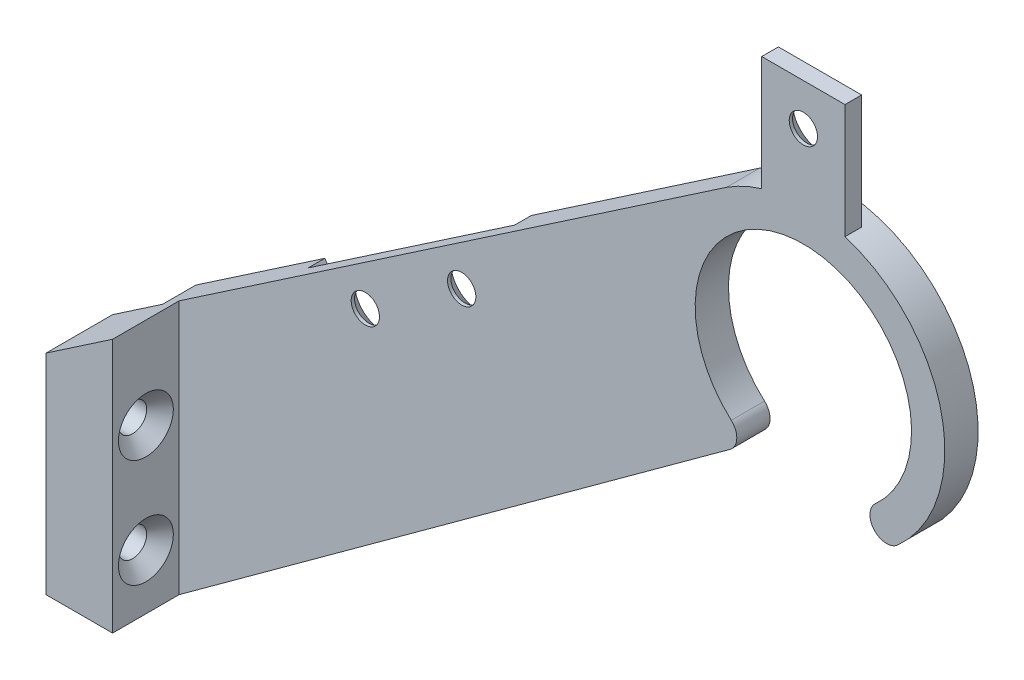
ISO-10303-21;
HEADER;
FILE_DESCRIPTION(('STEP AP214'),'2;1');
FILE_NAME('part.step','',(''),(''),'','','');
FILE_SCHEMA(('AUTOMOTIVE_DESIGN { 1 0 10303 214 1 1 1 1 }'));
ENDSEC;
DATA;
#1=APPLICATION_CONTEXT('core data for automotive mechanical design processes');
#2=APPLICATION_PROTOCOL_DEFINITION('international standard','automotive_design',2000,#1);
#3=PRODUCT_CONTEXT('',#1,'mechanical');
#4=PRODUCT('Part','Part','',(#3));
#5=PRODUCT_RELATED_PRODUCT_CATEGORY('part','',(#4));
#6=PRODUCT_DEFINITION_FORMATION('','',#4);
#7=PRODUCT_DEFINITION_CONTEXT('part definition',#1,'design');
#8=PRODUCT_DEFINITION('design','',#6,#7);
#9=PRODUCT_DEFINITION_SHAPE('','',#8);
#10=(LENGTH_UNIT() NAMED_UNIT(*) SI_UNIT(.MILLI.,.METRE.));
#11=(NAMED_UNIT(*) PLANE_ANGLE_UNIT() SI_UNIT($,.RADIAN.));
#12=(NAMED_UNIT(*) SI_UNIT($,.STERADIAN.) SOLID_ANGLE_UNIT());
#13=UNCERTAINTY_MEASURE_WITH_UNIT(LENGTH_MEASURE(1.E-05),#10,'distance_accuracy_value','');
#14=(GEOMETRIC_REPRESENTATION_CONTEXT(3) GLOBAL_UNCERTAINTY_ASSIGNED_CONTEXT((#13)) GLOBAL_UNIT_ASSIGNED_CONTEXT((#10,
#11,#12)) REPRESENTATION_CONTEXT('',''));
#15=CARTESIAN_POINT('',(0.,0.,0.));
#16=DIRECTION('',(0.,0.,1.));
#17=DIRECTION('',(1.,0.,0.));
#18=AXIS2_PLACEMENT_3D('',#15,#16,#17);
#19=CARTESIAN_POINT('',(-6.00000000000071,12.6393524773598,4.));
#20=DIRECTION('',(1.,0.,0.));
#21=DIRECTION('',(0.,1.,0.));
#22=AXIS2_PLACEMENT_3D('',#19,#20,#21);
#23=PLANE('',#22);
#24=CARTESIAN_POINT('',(-6.0000000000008,-5.86064752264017,8.));
#25=DIRECTION('',(1.,0.,0.));
#26=DIRECTION('',(0.,0.,-1.));
#27=AXIS2_PLACEMENT_3D('',#24,#25,#26);
#28=CIRCLE('',#27,1.7);
#29=CARTESIAN_POINT('',(-6.0000000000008,-5.86064752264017,6.3));
#30=VERTEX_POINT('',#29);
#31=EDGE_CURVE('E283',#30,#30,#28,.T.);
#32=ORIENTED_EDGE('',*,*,#31,.T.);
#33=EDGE_LOOP('',(#32));
#34=FACE_BOUND('',#33,.T.);
#35=CARTESIAN_POINT('',(-6.00000000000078,7.13935247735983,8.));
#36=DIRECTION('',(1.,0.,0.));
#37=DIRECTION('',(0.,0.,-1.));
#38=AXIS2_PLACEMENT_3D('',#35,#36,#37);
#39=CIRCLE('',#38,1.7);
#40=CARTESIAN_POINT('',(-6.00000000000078,7.13935247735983,6.3));
#41=VERTEX_POINT('',#40);
#42=EDGE_CURVE('E274',#41,#41,#39,.T.);
#43=ORIENTED_EDGE('',*,*,#42,.T.);
#44=EDGE_LOOP('',(#43));
#45=FACE_BOUND('',#44,.T.);
#46=DIRECTION('',(0.,1.,0.));
#47=VECTOR('',#46,1.);
#48=CARTESIAN_POINT('',(-6.00000000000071,12.6393524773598,4.));
#49=LINE('',#48,#47);
#50=CARTESIAN_POINT('',(-6.00000000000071,-12.5000000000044,4.));
#51=VERTEX_POINT('',#50);
#52=CARTESIAN_POINT('',(-6.00000000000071,12.6393524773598,4.));
#53=VERTEX_POINT('',#52);
#54=EDGE_CURVE('E178',#51,#53,#49,.T.);
#55=ORIENTED_EDGE('',*,*,#54,.F.);
#56=DIRECTION('',(0.,0.,-1.));
#57=VECTOR('',#56,1.);
#58=CARTESIAN_POINT('',(-6.00000000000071,-12.5000000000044,4.));
#59=LINE('',#58,#57);
#60=CARTESIAN_POINT('',(-6.00000000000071,-12.5000000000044,12.));
#61=VERTEX_POINT('',#60);
#62=EDGE_CURVE('E348',#61,#51,#59,.T.);
#63=ORIENTED_EDGE('',*,*,#62,.F.);
#64=DIRECTION('',(0.,-1.,0.));
#65=VECTOR('',#64,1.);
#66=CARTESIAN_POINT('',(-6.00000000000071,12.6393524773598,12.));
#67=LINE('',#66,#65);
#68=CARTESIAN_POINT('',(-6.00000000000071,12.6393524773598,12.));
#69=VERTEX_POINT('',#68);
#70=EDGE_CURVE('E290',#69,#61,#67,.T.);
#71=ORIENTED_EDGE('',*,*,#70,.F.);
#72=DIRECTION('',(0.,0.,-1.));
#73=VECTOR('',#72,1.);
#74=CARTESIAN_POINT('',(-6.00000000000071,12.6393524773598,4.));
#75=LINE('',#74,#73);
#76=EDGE_CURVE('E351',#69,#53,#75,.T.);
#77=ORIENTED_EDGE('',*,*,#76,.T.);
#78=EDGE_LOOP('',(#55,#63,#71,#77));
#79=FACE_BOUND('',#78,.T.);
#80=ADVANCED_FACE('F39',(#34,#45,#79),#23,.F.);
#81=CARTESIAN_POINT('',(76.9999999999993,48.4999999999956,4.));
#82=DIRECTION('',(0.,0.,-1.));
#83=DIRECTION('',(-1.,0.,0.));
#84=AXIS2_PLACEMENT_3D('',#81,#82,#83);
#85=CYLINDRICAL_SURFACE('',#84,17.);
#86=DIRECTION('',(0.,0.,-1.));
#87=VECTOR('',#86,1.);
#88=CARTESIAN_POINT('',(71.9999999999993,64.7480768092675,4.));
#89=LINE('',#88,#87);
#90=CARTESIAN_POINT('',(71.9999999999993,64.7480768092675,2.));
#91=VERTEX_POINT('',#90);
#92=CARTESIAN_POINT('',(71.9999999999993,64.7480768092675,4.));
#93=VERTEX_POINT('',#92);
#94=EDGE_CURVE('E224',#91,#93,#89,.F.);
#95=ORIENTED_EDGE('',*,*,#94,.F.);
#96=CARTESIAN_POINT('',(76.9999999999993,48.4999999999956,2.));
#97=DIRECTION('',(0.,0.,-1.));
#98=DIRECTION('',(-1.,0.,0.));
#99=AXIS2_PLACEMENT_3D('',#96,#97,#98);
#100=CIRCLE('',#99,17.);
#101=CARTESIAN_POINT('',(81.9999999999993,64.7480768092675,2.));
#102=VERTEX_POINT('',#101);
#103=EDGE_CURVE('E47',#91,#102,#100,.T.);
#104=ORIENTED_EDGE('',*,*,#103,.T.);
#105=DIRECTION('',(0.,0.,-1.));
#106=VECTOR('',#105,1.);
#107=CARTESIAN_POINT('',(81.9999999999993,64.7480768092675,4.));
#108=LINE('',#107,#106);
#109=CARTESIAN_POINT('',(81.9999999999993,64.7480768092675,4.));
#110=VERTEX_POINT('',#109);
#111=EDGE_CURVE('E222',#110,#102,#108,.T.);
#112=ORIENTED_EDGE('',*,*,#111,.F.);
#113=CARTESIAN_POINT('',(76.9999999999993,48.4999999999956,4.));
#114=DIRECTION('',(0.,0.,1.));
#115=DIRECTION('',(1.,0.,0.));
#116=AXIS2_PLACEMENT_3D('',#113,#114,#115);
#117=CIRCLE('',#116,17.);
#118=CARTESIAN_POINT('',(88.3333333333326,35.8289481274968,4.));
#119=VERTEX_POINT('',#118);
#120=EDGE_CURVE('E311',#119,#110,#117,.T.);
#121=ORIENTED_EDGE('',*,*,#120,.F.);
#122=DIRECTION('',(0.,0.,-1.));
#123=VECTOR('',#122,1.);
#124=CARTESIAN_POINT('',(88.3333333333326,35.8289481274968,4.));
#125=LINE('',#124,#123);
#126=CARTESIAN_POINT('',(88.3333333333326,35.8289481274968,0.));
#127=VERTEX_POINT('',#126);
#128=EDGE_CURVE('E356',#119,#127,#125,.T.);
#129=ORIENTED_EDGE('',*,*,#128,.T.);
#130=CARTESIAN_POINT('',(76.9999999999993,48.4999999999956,0.));
#131=DIRECTION('',(0.,0.,1.));
#132=DIRECTION('',(1.,0.,0.));
#133=AXIS2_PLACEMENT_3D('',#130,#131,#132);
#134=CIRCLE('',#133,17.);
#135=CARTESIAN_POINT('',(67.7706376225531,62.7765146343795,0.));
#136=VERTEX_POINT('',#135);
#137=EDGE_CURVE('E325',#127,#136,#134,.T.);
#138=ORIENTED_EDGE('',*,*,#137,.T.);
#139=DIRECTION('',(0.,0.,-1.));
#140=VECTOR('',#139,1.);
#141=CARTESIAN_POINT('',(67.7706376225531,62.7765146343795,4.));
#142=LINE('',#141,#140);
#143=CARTESIAN_POINT('',(67.7706376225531,62.7765146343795,4.));
#144=VERTEX_POINT('',#143);
#145=EDGE_CURVE('E353',#144,#136,#142,.T.);
#146=ORIENTED_EDGE('',*,*,#145,.F.);
#147=EDGE_CURVE('E309',#93,#144,#117,.T.);
#148=ORIENTED_EDGE('',*,*,#147,.F.);
#149=EDGE_LOOP('',(#95,#104,#112,#121,#129,#138,#146,#148));
#150=FACE_BOUND('',#149,.T.);
#151=ADVANCED_FACE('F452',(#150),#85,.T.);
#152=CARTESIAN_POINT('',(1.99999999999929,12.6393524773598,12.));
#153=DIRECTION('',(-1.,0.,0.));
#154=DIRECTION('',(0.,-1.,0.));
#155=AXIS2_PLACEMENT_3D('',#152,#153,#154);
#156=PLANE('',#155);
#157=CARTESIAN_POINT('',(1.99999999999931,7.13935247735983,8.));
#158=DIRECTION('',(1.,0.,0.));
#159=DIRECTION('',(0.,0.,-1.));
#160=AXIS2_PLACEMENT_3D('',#157,#158,#159);
#161=CIRCLE('',#160,3.3);
#162=CARTESIAN_POINT('',(1.99999999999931,7.13935247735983,4.7));
#163=VERTEX_POINT('',#162);
#164=EDGE_CURVE('E262',#163,#163,#161,.T.);
#165=ORIENTED_EDGE('',*,*,#164,.F.);
#166=EDGE_LOOP('',(#165));
#167=FACE_BOUND('',#166,.T.);
#168=DIRECTION('',(0.,1.,0.));
#169=VECTOR('',#168,1.);
#170=CARTESIAN_POINT('',(1.99999999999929,12.6393524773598,4.));
#171=LINE('',#170,#169);
#172=CARTESIAN_POINT('',(1.99999999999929,-12.5000000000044,4.));
#173=VERTEX_POINT('',#172);
#174=CARTESIAN_POINT('',(1.99999999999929,18.0764384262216,4.));
#175=VERTEX_POINT('',#174);
#176=EDGE_CURVE('E286',#173,#175,#171,.T.);
#177=ORIENTED_EDGE('',*,*,#176,.T.);
#178=DIRECTION('',(0.,0.,-1.));
#179=VECTOR('',#178,1.);
#180=CARTESIAN_POINT('',(1.99999999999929,18.0764384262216,12.));
#181=LINE('',#180,#179);
#182=CARTESIAN_POINT('',(1.99999999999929,18.0764384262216,12.));
#183=VERTEX_POINT('',#182);
#184=EDGE_CURVE('E297',#183,#175,#181,.T.);
#185=ORIENTED_EDGE('',*,*,#184,.F.);
#186=DIRECTION('',(0.,1.,0.));
#187=VECTOR('',#186,1.);
#188=CARTESIAN_POINT('',(1.99999999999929,12.6393524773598,12.));
#189=LINE('',#188,#187);
#190=CARTESIAN_POINT('',(1.99999999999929,-12.5000000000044,12.));
#191=VERTEX_POINT('',#190);
#192=EDGE_CURVE('E295',#191,#183,#189,.T.);
#193=ORIENTED_EDGE('',*,*,#192,.F.);
#194=DIRECTION('',(0.,0.,-1.));
#195=VECTOR('',#194,1.);
#196=CARTESIAN_POINT('',(1.99999999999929,-12.5000000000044,12.));
#197=LINE('',#196,#195);
#198=EDGE_CURVE('E302',#191,#173,#197,.T.);
#199=ORIENTED_EDGE('',*,*,#198,.T.);
#200=EDGE_LOOP('',(#177,#185,#193,#199));
#201=FACE_BOUND('',#200,.T.);
#202=CARTESIAN_POINT('',(1.99999999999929,-5.86064752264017,8.));
#203=DIRECTION('',(1.,0.,0.));
#204=DIRECTION('',(0.,0.,-1.));
#205=AXIS2_PLACEMENT_3D('',#202,#203,#204);
#206=CIRCLE('',#205,3.3);
#207=CARTESIAN_POINT('',(1.99999999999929,-5.86064752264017,4.7));
#208=VERTEX_POINT('',#207);
#209=EDGE_CURVE('E277',#208,#208,#206,.T.);
#210=ORIENTED_EDGE('',*,*,#209,.F.);
#211=EDGE_LOOP('',(#210));
#212=FACE_BOUND('',#211,.T.);
#213=ADVANCED_FACE('F432',(#167,#201,#212),#156,.F.);
#214=CARTESIAN_POINT('',(86.9999999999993,37.3196601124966,4.));
#215=DIRECTION('',(0.,0.,-1.));
#216=DIRECTION('',(-1.,0.,0.));
#217=AXIS2_PLACEMENT_3D('',#214,#215,#216);
#218=CYLINDRICAL_SURFACE('',#217,2.00000000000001);
#219=CARTESIAN_POINT('',(86.9999999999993,37.3196601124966,0.));
#220=DIRECTION('',(0.,0.,1.));
#221=DIRECTION('',(1.,0.,0.));
#222=AXIS2_PLACEMENT_3D('',#219,#220,#221);
#223=CIRCLE('',#222,2.00000000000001);
#224=CARTESIAN_POINT('',(85.666666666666,38.8103720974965,0.));
#225=VERTEX_POINT('',#224);
#226=EDGE_CURVE('E305',#225,#127,#223,.T.);
#227=ORIENTED_EDGE('',*,*,#226,.T.);
#228=ORIENTED_EDGE('',*,*,#128,.F.);
#229=CARTESIAN_POINT('',(86.9999999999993,37.3196601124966,4.));
#230=DIRECTION('',(0.,0.,1.));
#231=DIRECTION('',(1.,0.,0.));
#232=AXIS2_PLACEMENT_3D('',#229,#230,#231);
#233=CIRCLE('',#232,2.00000000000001);
#234=CARTESIAN_POINT('',(85.666666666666,38.8103720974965,4.));
#235=VERTEX_POINT('',#234);
#236=EDGE_CURVE('E306',#235,#119,#233,.T.);
#237=ORIENTED_EDGE('',*,*,#236,.F.);
#238=DIRECTION('',(0.,0.,-1.));
#239=VECTOR('',#238,1.);
#240=CARTESIAN_POINT('',(85.666666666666,38.8103720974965,4.));
#241=LINE('',#240,#239);
#242=EDGE_CURVE('E322',#235,#225,#241,.T.);
#243=ORIENTED_EDGE('',*,*,#242,.T.);
#244=EDGE_LOOP('',(#227,#228,#237,#243));
#245=FACE_BOUND('',#244,.T.);
#246=ADVANCED_FACE('F41',(#245),#218,.T.);
#247=CARTESIAN_POINT('',(-6.00000000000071,12.6393524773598,4.));
#248=DIRECTION('',(0.562103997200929,-0.827066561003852,0.));
#249=DIRECTION('',(0.827066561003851,0.562103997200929,0.));
#250=AXIS2_PLACEMENT_3D('',#247,#248,#249);
#251=PLANE('',#250);
#252=DIRECTION('',(-0.827066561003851,-0.562103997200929,0.));
#253=VECTOR('',#252,1.);
#254=CARTESIAN_POINT('',(-6.00000000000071,12.6393524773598,0.));
#255=LINE('',#254,#253);
#256=CARTESIAN_POINT('',(15.5031680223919,27.2536740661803,0.));
#257=VERTEX_POINT('',#256);
#258=CARTESIAN_POINT('',(-7.11236625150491E-13,16.7171669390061,0.));
#259=VERTEX_POINT('',#258);
#260=EDGE_CURVE('E192',#257,#259,#255,.T.);
#261=ORIENTED_EDGE('',*,*,#260,.T.);
#262=DIRECTION('',(0.,0.,-1.));
#263=VECTOR('',#262,1.);
#264=CARTESIAN_POINT('',(-7.14706072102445E-13,16.7171669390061,4.));
#265=LINE('',#264,#263);
#266=CARTESIAN_POINT('',(-7.14706072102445E-13,16.7171669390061,4.));
#267=VERTEX_POINT('',#266);
#268=EDGE_CURVE('E54',#267,#259,#265,.T.);
#269=ORIENTED_EDGE('',*,*,#268,.F.);
#270=DIRECTION('',(0.827066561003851,0.562103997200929,0.));
#271=VECTOR('',#270,1.);
#272=CARTESIAN_POINT('',(-6.00000000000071,12.6393524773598,4.));
#273=LINE('',#272,#271);
#274=EDGE_CURVE('E173',#53,#267,#273,.T.);
#275=ORIENTED_EDGE('',*,*,#274,.F.);
#276=ORIENTED_EDGE('',*,*,#76,.F.);
#277=DIRECTION('',(-0.827066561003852,-0.562103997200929,0.));
#278=VECTOR('',#277,1.);
#279=CARTESIAN_POINT('',(-6.00000000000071,12.6393524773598,12.));
#280=LINE('',#279,#278);
#281=EDGE_CURVE('E287',#183,#69,#280,.T.);
#282=ORIENTED_EDGE('',*,*,#281,.F.);
#283=ORIENTED_EDGE('',*,*,#184,.T.);
#284=DIRECTION('',(-0.827066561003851,-0.562103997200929,0.));
#285=VECTOR('',#284,1.);
#286=CARTESIAN_POINT('',(-6.00000000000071,12.6393524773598,4.));
#287=LINE('',#286,#285);
#288=EDGE_CURVE('E314',#144,#175,#287,.T.);
#289=ORIENTED_EDGE('',*,*,#288,.F.);
#290=ORIENTED_EDGE('',*,*,#145,.T.);
#291=CARTESIAN_POINT('',(40.3151648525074,44.1167939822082,0.));
#292=VERTEX_POINT('',#291);
#293=EDGE_CURVE('E327',#136,#292,#255,.T.);
#294=ORIENTED_EDGE('',*,*,#293,.T.);
#295=DIRECTION('',(0.,0.,-1.));
#296=VECTOR('',#295,1.);
#297=CARTESIAN_POINT('',(40.3151648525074,44.1167939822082,2.));
#298=LINE('',#297,#296);
#299=CARTESIAN_POINT('',(40.3151648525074,44.1167939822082,2.));
#300=VERTEX_POINT('',#299);
#301=EDGE_CURVE('E260',#300,#292,#298,.T.);
#302=ORIENTED_EDGE('',*,*,#301,.F.);
#303=DIRECTION('',(0.827066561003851,0.562103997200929,0.));
#304=VECTOR('',#303,1.);
#305=CARTESIAN_POINT('',(40.3151648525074,44.1167939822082,2.));
#306=LINE('',#305,#304);
#307=CARTESIAN_POINT('',(15.5031680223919,27.2536740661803,2.));
#308=VERTEX_POINT('',#307);
#309=EDGE_CURVE('E250',#308,#300,#306,.T.);
#310=ORIENTED_EDGE('',*,*,#309,.F.);
#311=DIRECTION('',(0.,0.,-1.));
#312=VECTOR('',#311,1.);
#313=CARTESIAN_POINT('',(15.5031680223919,27.2536740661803,2.));
#314=LINE('',#313,#312);
#315=EDGE_CURVE('E263',#308,#257,#314,.T.);
#316=ORIENTED_EDGE('',*,*,#315,.T.);
#317=EDGE_LOOP('',(#261,#269,#275,#276,#282,#283,#289,#290,#294,#302,#310,#316));
#318=FACE_BOUND('',#317,.T.);
#319=ADVANCED_FACE('F189',(#318),#251,.F.);
#320=CARTESIAN_POINT('',(-6.00000000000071,-12.5000000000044,4.));
#321=DIRECTION('',(0.,1.,0.));
#322=DIRECTION('',(-1.,0.,0.));
#323=AXIS2_PLACEMENT_3D('',#320,#321,#322);
#324=PLANE('',#323);
#325=DIRECTION('',(-1.,0.,0.));
#326=VECTOR('',#325,1.);
#327=CARTESIAN_POINT('',(-6.00000000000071,-12.5000000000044,4.));
#328=LINE('',#327,#326);
#329=CARTESIAN_POINT('',(-7.1701705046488E-13,-12.5000000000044,4.));
#330=VERTEX_POINT('',#329);
#331=EDGE_CURVE('E12',#330,#51,#328,.T.);
#332=ORIENTED_EDGE('',*,*,#331,.F.);
#333=DIRECTION('',(0.,0.,-1.));
#334=VECTOR('',#333,1.);
#335=CARTESIAN_POINT('',(-7.1730815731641E-13,-12.5000000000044,4.));
#336=LINE('',#335,#334);
#337=CARTESIAN_POINT('',(-7.1701705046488E-13,-12.5000000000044,0.));
#338=VERTEX_POINT('',#337);
#339=EDGE_CURVE('E185',#330,#338,#336,.T.);
#340=ORIENTED_EDGE('',*,*,#339,.T.);
#341=DIRECTION('',(1.,0.,0.));
#342=VECTOR('',#341,1.);
#343=CARTESIAN_POINT('',(-6.00000000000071,-12.5000000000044,0.));
#344=LINE('',#343,#342);
#345=CARTESIAN_POINT('',(1.99999999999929,-12.5000000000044,0.));
#346=VERTEX_POINT('',#345);
#347=EDGE_CURVE('E330',#338,#346,#344,.T.);
#348=ORIENTED_EDGE('',*,*,#347,.T.);
#349=DIRECTION('',(0.,0.,-1.));
#350=VECTOR('',#349,1.);
#351=CARTESIAN_POINT('',(1.99999999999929,-12.5000000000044,4.));
#352=LINE('',#351,#350);
#353=EDGE_CURVE('E345',#173,#346,#352,.T.);
#354=ORIENTED_EDGE('',*,*,#353,.F.);
#355=ORIENTED_EDGE('',*,*,#198,.F.);
#356=DIRECTION('',(1.,0.,0.));
#357=VECTOR('',#356,1.);
#358=CARTESIAN_POINT('',(-6.00000000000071,-12.5000000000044,12.));
#359=LINE('',#358,#357);
#360=EDGE_CURVE('E293',#61,#191,#359,.T.);
#361=ORIENTED_EDGE('',*,*,#360,.F.);
#362=ORIENTED_EDGE('',*,*,#62,.T.);
#363=EDGE_LOOP('',(#332,#340,#348,#354,#355,#361,#362));
#364=FACE_BOUND('',#363,.T.);
#365=ADVANCED_FACE('F420',(#364),#324,.F.);
#366=CARTESIAN_POINT('',(1.99999999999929,-12.5000000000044,4.));
#367=DIRECTION('',(-0.588762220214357,0.808306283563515,0.));
#368=DIRECTION('',(-0.808306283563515,-0.588762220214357,0.));
#369=AXIS2_PLACEMENT_3D('',#366,#367,#368);
#370=PLANE('',#369);
#371=DIRECTION('',(0.808306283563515,0.588762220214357,0.));
#372=VECTOR('',#371,1.);
#373=CARTESIAN_POINT('',(1.99999999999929,-12.5000000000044,0.));
#374=LINE('',#373,#372);
#375=CARTESIAN_POINT('',(68.177524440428,35.7030475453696,0.));
#376=VERTEX_POINT('',#375);
#377=EDGE_CURVE('E332',#346,#376,#374,.T.);
#378=ORIENTED_EDGE('',*,*,#377,.T.);
#379=DIRECTION('',(0.,0.,-1.));
#380=VECTOR('',#379,1.);
#381=CARTESIAN_POINT('',(68.177524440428,35.7030475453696,4.));
#382=LINE('',#381,#380);
#383=CARTESIAN_POINT('',(68.177524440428,35.7030475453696,4.));
#384=VERTEX_POINT('',#383);
#385=EDGE_CURVE('E342',#384,#376,#382,.T.);
#386=ORIENTED_EDGE('',*,*,#385,.F.);
#387=DIRECTION('',(0.808306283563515,0.588762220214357,0.));
#388=VECTOR('',#387,1.);
#389=CARTESIAN_POINT('',(1.99999999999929,-12.5000000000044,4.));
#390=LINE('',#389,#388);
#391=EDGE_CURVE('E316',#173,#384,#390,.T.);
#392=ORIENTED_EDGE('',*,*,#391,.F.);
#393=ORIENTED_EDGE('',*,*,#353,.T.);
#394=EDGE_LOOP('',(#378,#386,#392,#393));
#395=FACE_BOUND('',#394,.T.);
#396=ADVANCED_FACE('F437',(#395),#370,.F.);
#397=CARTESIAN_POINT('',(66.9999999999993,37.3196601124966,4.));
#398=DIRECTION('',(0.,0.,-1.));
#399=DIRECTION('',(-1.,0.,0.));
#400=AXIS2_PLACEMENT_3D('',#397,#398,#399);
#401=CYLINDRICAL_SURFACE('',#400,2.);
#402=CARTESIAN_POINT('',(66.9999999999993,37.3196601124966,0.));
#403=DIRECTION('',(0.,0.,1.));
#404=DIRECTION('',(1.,0.,0.));
#405=AXIS2_PLACEMENT_3D('',#402,#403,#404);
#406=CIRCLE('',#405,2.);
#407=CARTESIAN_POINT('',(68.3333333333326,38.8103720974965,0.));
#408=VERTEX_POINT('',#407);
#409=EDGE_CURVE('E334',#376,#408,#406,.T.);
#410=ORIENTED_EDGE('',*,*,#409,.T.);
#411=DIRECTION('',(0.,0.,-1.));
#412=VECTOR('',#411,1.);
#413=CARTESIAN_POINT('',(68.3333333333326,38.8103720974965,4.));
#414=LINE('',#413,#412);
#415=CARTESIAN_POINT('',(68.3333333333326,38.8103720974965,4.));
#416=VERTEX_POINT('',#415);
#417=EDGE_CURVE('E339',#416,#408,#414,.T.);
#418=ORIENTED_EDGE('',*,*,#417,.F.);
#419=CARTESIAN_POINT('',(66.9999999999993,37.3196601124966,4.));
#420=DIRECTION('',(0.,0.,1.));
#421=DIRECTION('',(1.,0.,0.));
#422=AXIS2_PLACEMENT_3D('',#419,#420,#421);
#423=CIRCLE('',#422,2.);
#424=EDGE_CURVE('E318',#384,#416,#423,.T.);
#425=ORIENTED_EDGE('',*,*,#424,.F.);
#426=ORIENTED_EDGE('',*,*,#385,.T.);
#427=EDGE_LOOP('',(#410,#418,#425,#426));
#428=FACE_BOUND('',#427,.T.);
#429=ADVANCED_FACE('F442',(#428),#401,.T.);
#430=CARTESIAN_POINT('',(76.9999999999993,48.4999999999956,4.));
#431=DIRECTION('',(0.,0.,-1.));
#432=DIRECTION('',(-1.,0.,0.));
#433=AXIS2_PLACEMENT_3D('',#430,#431,#432);
#434=CYLINDRICAL_SURFACE('',#433,13.);
#435=CARTESIAN_POINT('',(76.9999999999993,48.4999999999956,0.));
#436=DIRECTION('',(0.,0.,-1.));
#437=DIRECTION('',(1.,0.,0.));
#438=AXIS2_PLACEMENT_3D('',#435,#436,#437);
#439=CIRCLE('',#438,13.);
#440=EDGE_CURVE('E310',#408,#225,#439,.T.);
#441=ORIENTED_EDGE('',*,*,#440,.T.);
#442=ORIENTED_EDGE('',*,*,#242,.F.);
#443=CARTESIAN_POINT('',(76.9999999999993,48.4999999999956,4.));
#444=DIRECTION('',(0.,0.,-1.));
#445=DIRECTION('',(1.,0.,0.));
#446=AXIS2_PLACEMENT_3D('',#443,#444,#445);
#447=CIRCLE('',#446,13.);
#448=EDGE_CURVE('E320',#416,#235,#447,.T.);
#449=ORIENTED_EDGE('',*,*,#448,.F.);
#450=ORIENTED_EDGE('',*,*,#417,.T.);
#451=EDGE_LOOP('',(#441,#442,#449,#450));
#452=FACE_BOUND('',#451,.T.);
#453=ADVANCED_FACE('F373',(#452),#434,.F.);
#454=CARTESIAN_POINT('',(86.9999999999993,37.3196601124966,4.));
#455=DIRECTION('',(0.,0.,1.));
#456=DIRECTION('',(1.,0.,0.));
#457=AXIS2_PLACEMENT_3D('',#454,#455,#456);
#458=PLANE('',#457);
#459=CARTESIAN_POINT('',(76.9999999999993,73.4999999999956,4.));
#460=DIRECTION('',(0.,0.,1.));
#461=DIRECTION('',(1.,0.,0.));
#462=AXIS2_PLACEMENT_3D('',#459,#460,#461);
#463=CIRCLE('',#462,1.69999999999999);
#464=CARTESIAN_POINT('',(78.6999999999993,73.4999999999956,4.));
#465=VERTEX_POINT('',#464);
#466=EDGE_CURVE('E203',#465,#465,#463,.T.);
#467=ORIENTED_EDGE('',*,*,#466,.F.);
#468=EDGE_LOOP('',(#467));
#469=FACE_BOUND('',#468,.T.);
#470=ORIENTED_EDGE('',*,*,#120,.T.);
#471=DIRECTION('',(0.,-1.,0.));
#472=VECTOR('',#471,1.);
#473=CARTESIAN_POINT('',(81.9999999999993,64.7430128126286,4.));
#474=LINE('',#473,#472);
#475=CARTESIAN_POINT('',(81.9999999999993,78.4999999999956,4.));
#476=VERTEX_POINT('',#475);
#477=EDGE_CURVE('E207',#476,#110,#474,.T.);
#478=ORIENTED_EDGE('',*,*,#477,.F.);
#479=DIRECTION('',(1.,0.,0.));
#480=VECTOR('',#479,1.);
#481=CARTESIAN_POINT('',(81.9999999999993,78.4999999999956,4.));
#482=LINE('',#481,#480);
#483=CARTESIAN_POINT('',(71.9999999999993,78.4999999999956,4.));
#484=VERTEX_POINT('',#483);
#485=EDGE_CURVE('E214',#484,#476,#482,.T.);
#486=ORIENTED_EDGE('',*,*,#485,.F.);
#487=DIRECTION('',(0.,1.,0.));
#488=VECTOR('',#487,1.);
#489=CARTESIAN_POINT('',(71.9999999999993,64.7430128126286,4.));
#490=LINE('',#489,#488);
#491=EDGE_CURVE('E62',#93,#484,#490,.T.);
#492=ORIENTED_EDGE('',*,*,#491,.F.);
#493=ORIENTED_EDGE('',*,*,#147,.T.);
#494=ORIENTED_EDGE('',*,*,#288,.T.);
#495=ORIENTED_EDGE('',*,*,#176,.F.);
#496=ORIENTED_EDGE('',*,*,#391,.T.);
#497=ORIENTED_EDGE('',*,*,#424,.T.);
#498=ORIENTED_EDGE('',*,*,#448,.T.);
#499=ORIENTED_EDGE('',*,*,#236,.T.);
#500=EDGE_LOOP('',(#470,#478,#486,#492,#493,#494,#495,#496,#497,#498,#499));
#501=FACE_BOUND('',#500,.T.);
#502=CARTESIAN_POINT('',(35.9470483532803,36.3116957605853,4.));
#503=DIRECTION('',(0.,0.,1.));
#504=DIRECTION('',(1.,0.,0.));
#505=AXIS2_PLACEMENT_3D('',#502,#503,#504);
#506=CIRCLE('',#505,1.69999999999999);
#507=CARTESIAN_POINT('',(37.6470483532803,36.3116957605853,4.));
#508=VERTEX_POINT('',#507);
#509=EDGE_CURVE('E232',#508,#508,#506,.T.);
#510=ORIENTED_EDGE('',*,*,#509,.F.);
#511=EDGE_LOOP('',(#510));
#512=FACE_BOUND('',#511,.T.);
#513=CARTESIAN_POINT('',(24.3681164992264,28.4422397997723,4.));
#514=DIRECTION('',(0.,0.,1.));
#515=DIRECTION('',(1.,0.,0.));
#516=AXIS2_PLACEMENT_3D('',#513,#514,#515);
#517=CIRCLE('',#516,1.69999999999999);
#518=CARTESIAN_POINT('',(26.0681164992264,28.4422397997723,4.));
#519=VERTEX_POINT('',#518);
#520=EDGE_CURVE('E239',#519,#519,#517,.T.);
#521=ORIENTED_EDGE('',*,*,#520,.F.);
#522=EDGE_LOOP('',(#521));
#523=FACE_BOUND('',#522,.T.);
#524=ADVANCED_FACE('F370',(#469,#501,#512,#523),#458,.T.);
#525=CARTESIAN_POINT('',(86.9999999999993,37.3196601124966,0.));
#526=DIRECTION('',(0.,0.,1.));
#527=DIRECTION('',(1.,0.,0.));
#528=AXIS2_PLACEMENT_3D('',#525,#526,#527);
#529=PLANE('',#528);
#530=ORIENTED_EDGE('',*,*,#347,.F.);
#531=DIRECTION('',(0.,-1.,0.));
#532=VECTOR('',#531,1.);
#533=CARTESIAN_POINT('',(-7.14706072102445E-13,16.7171669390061,0.));
#534=LINE('',#533,#532);
#535=EDGE_CURVE('E186',#259,#338,#534,.T.);
#536=ORIENTED_EDGE('',*,*,#535,.F.);
#537=ORIENTED_EDGE('',*,*,#260,.F.);
#538=DIRECTION('',(-0.56210399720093,0.827066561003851,0.));
#539=VECTOR('',#538,1.);
#540=CARTESIAN_POINT('',(15.5031680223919,27.2536740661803,0.));
#541=LINE('',#540,#539);
#542=CARTESIAN_POINT('',(19.9999999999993,20.6371415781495,0.));
#543=VERTEX_POINT('',#542);
#544=EDGE_CURVE('E244',#543,#257,#541,.T.);
#545=ORIENTED_EDGE('',*,*,#544,.F.);
#546=DIRECTION('',(-0.827066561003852,-0.562103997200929,0.));
#547=VECTOR('',#546,1.);
#548=CARTESIAN_POINT('',(19.9999999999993,20.6371415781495,0.));
#549=LINE('',#548,#547);
#550=CARTESIAN_POINT('',(44.8119968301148,37.5002614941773,0.));
#551=VERTEX_POINT('',#550);
#552=EDGE_CURVE('E256',#551,#543,#549,.T.);
#553=ORIENTED_EDGE('',*,*,#552,.F.);
#554=DIRECTION('',(0.562103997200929,-0.827066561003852,0.));
#555=VECTOR('',#554,1.);
#556=CARTESIAN_POINT('',(44.8119968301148,37.5002614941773,0.));
#557=LINE('',#556,#555);
#558=EDGE_CURVE('E254',#292,#551,#557,.T.);
#559=ORIENTED_EDGE('',*,*,#558,.F.);
#560=ORIENTED_EDGE('',*,*,#293,.F.);
#561=ORIENTED_EDGE('',*,*,#137,.F.);
#562=ORIENTED_EDGE('',*,*,#226,.F.);
#563=ORIENTED_EDGE('',*,*,#440,.F.);
#564=ORIENTED_EDGE('',*,*,#409,.F.);
#565=ORIENTED_EDGE('',*,*,#377,.F.);
#566=EDGE_LOOP('',(#530,#536,#537,#545,#553,#559,#560,#561,#562,#563,#564,#565));
#567=FACE_BOUND('',#566,.T.);
#568=ADVANCED_FACE('F372',(#567),#529,.F.);
#569=CARTESIAN_POINT('',(0.,0.,12.));
#570=DIRECTION('',(0.,0.,1.));
#571=DIRECTION('',(1.,0.,0.));
#572=AXIS2_PLACEMENT_3D('',#569,#570,#571);
#573=PLANE('',#572);
#574=ORIENTED_EDGE('',*,*,#281,.T.);
#575=ORIENTED_EDGE('',*,*,#70,.T.);
#576=ORIENTED_EDGE('',*,*,#360,.T.);
#577=ORIENTED_EDGE('',*,*,#192,.T.);
#578=EDGE_LOOP('',(#574,#575,#576,#577));
#579=FACE_BOUND('',#578,.T.);
#580=ADVANCED_FACE('F428',(#579),#573,.T.);
#581=CARTESIAN_POINT('',(1.99999999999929,-5.86064752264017,8.));
#582=DIRECTION('',(1.,0.,0.));
#583=DIRECTION('',(0.,0.,-1.));
#584=AXIS2_PLACEMENT_3D('',#581,#582,#583);
#585=CYLINDRICAL_SURFACE('',#584,1.69999999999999);
#586=ORIENTED_EDGE('',*,*,#31,.F.);
#587=EDGE_LOOP('',(#586));
#588=FACE_BOUND('',#587,.T.);
#589=CARTESIAN_POINT('',(0.399999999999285,-5.86064752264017,8.));
#590=DIRECTION('',(1.,0.,0.));
#591=DIRECTION('',(0.,0.,-1.));
#592=AXIS2_PLACEMENT_3D('',#589,#590,#591);
#593=CIRCLE('',#592,1.69999999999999);
#594=CARTESIAN_POINT('',(0.399999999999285,-5.86064752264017,6.30000000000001));
#595=VERTEX_POINT('',#594);
#596=EDGE_CURVE('E280',#595,#595,#593,.T.);
#597=ORIENTED_EDGE('',*,*,#596,.T.);
#598=EDGE_LOOP('',(#597));
#599=FACE_BOUND('',#598,.T.);
#600=ADVANCED_FACE('F547',(#588,#599),#585,.F.);
#601=CARTESIAN_POINT('',(1.99999999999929,-5.86064752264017,8.));
#602=DIRECTION('',(1.,0.,0.));
#603=DIRECTION('',(0.,0.,-1.));
#604=AXIS2_PLACEMENT_3D('',#601,#602,#603);
#605=CONICAL_SURFACE('',#604,3.3,0.78539816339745);
#606=ORIENTED_EDGE('',*,*,#596,.F.);
#607=EDGE_LOOP('',(#606));
#608=FACE_BOUND('',#607,.T.);
#609=ORIENTED_EDGE('',*,*,#209,.T.);
#610=EDGE_LOOP('',(#609));
#611=FACE_BOUND('',#610,.T.);
#612=ADVANCED_FACE('F553',(#608,#611),#605,.F.);
#613=CARTESIAN_POINT('',(1.99999999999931,7.13935247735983,8.));
#614=DIRECTION('',(1.,0.,0.));
#615=DIRECTION('',(0.,0.,-1.));
#616=AXIS2_PLACEMENT_3D('',#613,#614,#615);
#617=CYLINDRICAL_SURFACE('',#616,1.69999999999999);
#618=ORIENTED_EDGE('',*,*,#42,.F.);
#619=EDGE_LOOP('',(#618));
#620=FACE_BOUND('',#619,.T.);
#621=CARTESIAN_POINT('',(0.399999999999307,7.13935247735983,8.));
#622=DIRECTION('',(1.,0.,0.));
#623=DIRECTION('',(0.,0.,-1.));
#624=AXIS2_PLACEMENT_3D('',#621,#622,#623);
#625=CIRCLE('',#624,1.69999999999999);
#626=CARTESIAN_POINT('',(0.399999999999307,7.13935247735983,6.30000000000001));
#627=VERTEX_POINT('',#626);
#628=EDGE_CURVE('E271',#627,#627,#625,.T.);
#629=ORIENTED_EDGE('',*,*,#628,.T.);
#630=EDGE_LOOP('',(#629));
#631=FACE_BOUND('',#630,.T.);
#632=ADVANCED_FACE('F560',(#620,#631),#617,.F.);
#633=CARTESIAN_POINT('',(1.99999999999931,7.13935247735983,8.));
#634=DIRECTION('',(1.,0.,0.));
#635=DIRECTION('',(0.,0.,-1.));
#636=AXIS2_PLACEMENT_3D('',#633,#634,#635);
#637=CONICAL_SURFACE('',#636,3.3,0.78539816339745);
#638=ORIENTED_EDGE('',*,*,#628,.F.);
#639=EDGE_LOOP('',(#638));
#640=FACE_BOUND('',#639,.T.);
#641=ORIENTED_EDGE('',*,*,#164,.T.);
#642=EDGE_LOOP('',(#641));
#643=FACE_BOUND('',#642,.T.);
#644=ADVANCED_FACE('F568',(#640,#643),#637,.F.);
#645=CARTESIAN_POINT('',(44.8119968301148,37.5002614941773,2.));
#646=DIRECTION('',(0.827066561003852,0.562103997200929,0.));
#647=DIRECTION('',(-0.562103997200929,0.827066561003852,0.));
#648=AXIS2_PLACEMENT_3D('',#645,#646,#647);
#649=PLANE('',#648);
#650=ORIENTED_EDGE('',*,*,#558,.T.);
#651=DIRECTION('',(0.,0.,-1.));
#652=VECTOR('',#651,1.);
#653=CARTESIAN_POINT('',(44.8119968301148,37.5002614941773,2.));
#654=LINE('',#653,#652);
#655=CARTESIAN_POINT('',(44.8119968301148,37.5002614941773,2.));
#656=VERTEX_POINT('',#655);
#657=EDGE_CURVE('E253',#656,#551,#654,.T.);
#658=ORIENTED_EDGE('',*,*,#657,.F.);
#659=DIRECTION('',(0.562103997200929,-0.827066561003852,0.));
#660=VECTOR('',#659,1.);
#661=CARTESIAN_POINT('',(44.8119968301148,37.5002614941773,2.));
#662=LINE('',#661,#660);
#663=EDGE_CURVE('E240',#300,#656,#662,.T.);
#664=ORIENTED_EDGE('',*,*,#663,.F.);
#665=ORIENTED_EDGE('',*,*,#301,.T.);
#666=EDGE_LOOP('',(#650,#658,#664,#665));
#667=FACE_BOUND('',#666,.T.);
#668=ADVANCED_FACE('F404',(#667),#649,.F.);
#669=CARTESIAN_POINT('',(15.5031680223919,27.2536740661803,2.));
#670=DIRECTION('',(-0.827066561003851,-0.56210399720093,0.));
#671=DIRECTION('',(0.56210399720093,-0.827066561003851,0.));
#672=AXIS2_PLACEMENT_3D('',#669,#670,#671);
#673=PLANE('',#672);
#674=ORIENTED_EDGE('',*,*,#544,.T.);
#675=ORIENTED_EDGE('',*,*,#315,.F.);
#676=DIRECTION('',(-0.56210399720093,0.827066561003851,0.));
#677=VECTOR('',#676,1.);
#678=CARTESIAN_POINT('',(15.5031680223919,27.2536740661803,2.));
#679=LINE('',#678,#677);
#680=CARTESIAN_POINT('',(19.9999999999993,20.6371415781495,2.));
#681=VERTEX_POINT('',#680);
#682=EDGE_CURVE('E247',#681,#308,#679,.T.);
#683=ORIENTED_EDGE('',*,*,#682,.F.);
#684=DIRECTION('',(0.,0.,-1.));
#685=VECTOR('',#684,1.);
#686=CARTESIAN_POINT('',(19.9999999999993,20.6371415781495,2.));
#687=LINE('',#686,#685);
#688=EDGE_CURVE('E265',#681,#543,#687,.T.);
#689=ORIENTED_EDGE('',*,*,#688,.T.);
#690=EDGE_LOOP('',(#674,#675,#683,#689));
#691=FACE_BOUND('',#690,.T.);
#692=ADVANCED_FACE('F411',(#691),#673,.F.);
#693=CARTESIAN_POINT('',(19.9999999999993,20.6371415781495,2.));
#694=DIRECTION('',(0.562103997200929,-0.827066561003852,0.));
#695=DIRECTION('',(0.827066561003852,0.562103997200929,0.));
#696=AXIS2_PLACEMENT_3D('',#693,#694,#695);
#697=PLANE('',#696);
#698=ORIENTED_EDGE('',*,*,#552,.T.);
#699=ORIENTED_EDGE('',*,*,#688,.F.);
#700=DIRECTION('',(-0.827066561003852,-0.562103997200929,0.));
#701=VECTOR('',#700,1.);
#702=CARTESIAN_POINT('',(19.9999999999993,20.6371415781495,2.));
#703=LINE('',#702,#701);
#704=EDGE_CURVE('E243',#656,#681,#703,.T.);
#705=ORIENTED_EDGE('',*,*,#704,.F.);
#706=ORIENTED_EDGE('',*,*,#657,.T.);
#707=EDGE_LOOP('',(#698,#699,#705,#706));
#708=FACE_BOUND('',#707,.T.);
#709=ADVANCED_FACE('F397',(#708),#697,.F.);
#710=CARTESIAN_POINT('',(0.,0.,2.));
#711=DIRECTION('',(0.,0.,1.));
#712=DIRECTION('',(1.,0.,0.));
#713=AXIS2_PLACEMENT_3D('',#710,#711,#712);
#714=PLANE('',#713);
#715=CARTESIAN_POINT('',(35.9470483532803,36.3116957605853,2.));
#716=DIRECTION('',(0.,0.,-1.));
#717=DIRECTION('',(-1.,0.,0.));
#718=AXIS2_PLACEMENT_3D('',#715,#716,#717);
#719=CIRCLE('',#718,3.3);
#720=CARTESIAN_POINT('',(32.6470483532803,36.3116957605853,2.));
#721=VERTEX_POINT('',#720);
#722=EDGE_CURVE('E226',#721,#721,#719,.T.);
#723=ORIENTED_EDGE('',*,*,#722,.F.);
#724=EDGE_LOOP('',(#723));
#725=FACE_BOUND('',#724,.T.);
#726=CARTESIAN_POINT('',(24.3681164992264,28.4422397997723,2.));
#727=DIRECTION('',(0.,0.,-1.));
#728=DIRECTION('',(-1.,0.,0.));
#729=AXIS2_PLACEMENT_3D('',#726,#727,#728);
#730=CIRCLE('',#729,3.3);
#731=CARTESIAN_POINT('',(21.0681164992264,28.4422397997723,2.));
#732=VERTEX_POINT('',#731);
#733=EDGE_CURVE('E233',#732,#732,#730,.T.);
#734=ORIENTED_EDGE('',*,*,#733,.F.);
#735=EDGE_LOOP('',(#734));
#736=FACE_BOUND('',#735,.T.);
#737=ORIENTED_EDGE('',*,*,#663,.T.);
#738=ORIENTED_EDGE('',*,*,#704,.T.);
#739=ORIENTED_EDGE('',*,*,#682,.T.);
#740=ORIENTED_EDGE('',*,*,#309,.T.);
#741=EDGE_LOOP('',(#737,#738,#739,#740));
#742=FACE_BOUND('',#741,.T.);
#743=ADVANCED_FACE('F385',(#725,#736,#742),#714,.F.);
#744=CARTESIAN_POINT('',(24.3681164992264,28.4422397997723,2.));
#745=DIRECTION('',(0.,0.,-1.));
#746=DIRECTION('',(-1.,0.,0.));
#747=AXIS2_PLACEMENT_3D('',#744,#745,#746);
#748=CYLINDRICAL_SURFACE('',#747,1.69999999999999);
#749=ORIENTED_EDGE('',*,*,#520,.T.);
#750=EDGE_LOOP('',(#749));
#751=FACE_BOUND('',#750,.T.);
#752=CARTESIAN_POINT('',(24.3681164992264,28.4422397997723,3.6));
#753=DIRECTION('',(0.,0.,-1.));
#754=DIRECTION('',(-1.,0.,0.));
#755=AXIS2_PLACEMENT_3D('',#752,#753,#754);
#756=CIRCLE('',#755,1.69999999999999);
#757=CARTESIAN_POINT('',(22.6681164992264,28.4422397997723,3.6));
#758=VERTEX_POINT('',#757);
#759=EDGE_CURVE('E236',#758,#758,#756,.T.);
#760=ORIENTED_EDGE('',*,*,#759,.T.);
#761=EDGE_LOOP('',(#760));
#762=FACE_BOUND('',#761,.T.);
#763=ADVANCED_FACE('F381',(#751,#762),#748,.F.);
#764=CARTESIAN_POINT('',(24.3681164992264,28.4422397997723,2.));
#765=DIRECTION('',(0.,0.,-1.));
#766=DIRECTION('',(-1.,0.,0.));
#767=AXIS2_PLACEMENT_3D('',#764,#765,#766);
#768=CONICAL_SURFACE('',#767,3.3,0.78539816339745);
#769=ORIENTED_EDGE('',*,*,#759,.F.);
#770=EDGE_LOOP('',(#769));
#771=FACE_BOUND('',#770,.T.);
#772=ORIENTED_EDGE('',*,*,#733,.T.);
#773=EDGE_LOOP('',(#772));
#774=FACE_BOUND('',#773,.T.);
#775=ADVANCED_FACE('F384',(#771,#774),#768,.F.);
#776=CARTESIAN_POINT('',(35.9470483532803,36.3116957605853,2.));
#777=DIRECTION('',(0.,0.,-1.));
#778=DIRECTION('',(-1.,0.,0.));
#779=AXIS2_PLACEMENT_3D('',#776,#777,#778);
#780=CYLINDRICAL_SURFACE('',#779,1.69999999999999);
#781=ORIENTED_EDGE('',*,*,#509,.T.);
#782=EDGE_LOOP('',(#781));
#783=FACE_BOUND('',#782,.T.);
#784=CARTESIAN_POINT('',(35.9470483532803,36.3116957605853,3.6));
#785=DIRECTION('',(0.,0.,-1.));
#786=DIRECTION('',(-1.,0.,0.));
#787=AXIS2_PLACEMENT_3D('',#784,#785,#786);
#788=CIRCLE('',#787,1.69999999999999);
#789=CARTESIAN_POINT('',(34.2470483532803,36.3116957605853,3.6));
#790=VERTEX_POINT('',#789);
#791=EDGE_CURVE('E229',#790,#790,#788,.T.);
#792=ORIENTED_EDGE('',*,*,#791,.T.);
#793=EDGE_LOOP('',(#792));
#794=FACE_BOUND('',#793,.T.);
#795=ADVANCED_FACE('F391',(#783,#794),#780,.F.);
#796=CARTESIAN_POINT('',(35.9470483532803,36.3116957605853,2.));
#797=DIRECTION('',(0.,0.,-1.));
#798=DIRECTION('',(-1.,0.,0.));
#799=AXIS2_PLACEMENT_3D('',#796,#797,#798);
#800=CONICAL_SURFACE('',#799,3.3,0.78539816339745);
#801=ORIENTED_EDGE('',*,*,#791,.F.);
#802=EDGE_LOOP('',(#801));
#803=FACE_BOUND('',#802,.T.);
#804=ORIENTED_EDGE('',*,*,#722,.T.);
#805=EDGE_LOOP('',(#804));
#806=FACE_BOUND('',#805,.T.);
#807=ADVANCED_FACE('F469',(#803,#806),#800,.F.);
#808=CARTESIAN_POINT('',(71.9999999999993,64.7430128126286,2.));
#809=DIRECTION('',(1.,0.,0.));
#810=DIRECTION('',(0.,0.,-1.));
#811=AXIS2_PLACEMENT_3D('',#808,#809,#810);
#812=PLANE('',#811);
#813=DIRECTION('',(0.,1.,0.));
#814=VECTOR('',#813,1.);
#815=CARTESIAN_POINT('',(71.9999999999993,64.7430128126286,2.));
#816=LINE('',#815,#814);
#817=CARTESIAN_POINT('',(71.9999999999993,78.4999999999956,2.));
#818=VERTEX_POINT('',#817);
#819=EDGE_CURVE('E204',#91,#818,#816,.T.);
#820=ORIENTED_EDGE('',*,*,#819,.F.);
#821=ORIENTED_EDGE('',*,*,#94,.T.);
#822=ORIENTED_EDGE('',*,*,#491,.T.);
#823=DIRECTION('',(0.,0.,1.));
#824=VECTOR('',#823,1.);
#825=CARTESIAN_POINT('',(71.9999999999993,78.4999999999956,2.));
#826=LINE('',#825,#824);
#827=EDGE_CURVE('E219',#818,#484,#826,.T.);
#828=ORIENTED_EDGE('',*,*,#827,.F.);
#829=EDGE_LOOP('',(#820,#821,#822,#828));
#830=FACE_BOUND('',#829,.T.);
#831=ADVANCED_FACE('F466',(#830),#812,.F.);
#832=CARTESIAN_POINT('',(81.9999999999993,64.7430128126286,2.));
#833=DIRECTION('',(-1.,0.,0.));
#834=DIRECTION('',(0.,0.,1.));
#835=AXIS2_PLACEMENT_3D('',#832,#833,#834);
#836=PLANE('',#835);
#837=ORIENTED_EDGE('',*,*,#477,.T.);
#838=ORIENTED_EDGE('',*,*,#111,.T.);
#839=DIRECTION('',(0.,-1.,0.));
#840=VECTOR('',#839,1.);
#841=CARTESIAN_POINT('',(81.9999999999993,64.7430128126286,2.));
#842=LINE('',#841,#840);
#843=CARTESIAN_POINT('',(81.9999999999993,78.4999999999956,2.));
#844=VERTEX_POINT('',#843);
#845=EDGE_CURVE('E209',#844,#102,#842,.T.);
#846=ORIENTED_EDGE('',*,*,#845,.F.);
#847=DIRECTION('',(0.,0.,1.));
#848=VECTOR('',#847,1.);
#849=CARTESIAN_POINT('',(81.9999999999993,78.4999999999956,2.));
#850=LINE('',#849,#848);
#851=EDGE_CURVE('E212',#844,#476,#850,.T.);
#852=ORIENTED_EDGE('',*,*,#851,.T.);
#853=EDGE_LOOP('',(#837,#838,#846,#852));
#854=FACE_BOUND('',#853,.T.);
#855=ADVANCED_FACE('F456',(#854),#836,.F.);
#856=CARTESIAN_POINT('',(81.9999999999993,78.4999999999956,2.));
#857=DIRECTION('',(0.,-1.,0.));
#858=DIRECTION('',(0.,0.,-1.));
#859=AXIS2_PLACEMENT_3D('',#856,#857,#858);
#860=PLANE('',#859);
#861=ORIENTED_EDGE('',*,*,#485,.T.);
#862=ORIENTED_EDGE('',*,*,#851,.F.);
#863=DIRECTION('',(1.,0.,0.));
#864=VECTOR('',#863,1.);
#865=CARTESIAN_POINT('',(81.9999999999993,78.4999999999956,2.));
#866=LINE('',#865,#864);
#867=EDGE_CURVE('E206',#818,#844,#866,.T.);
#868=ORIENTED_EDGE('',*,*,#867,.F.);
#869=ORIENTED_EDGE('',*,*,#827,.T.);
#870=EDGE_LOOP('',(#861,#862,#868,#869));
#871=FACE_BOUND('',#870,.T.);
#872=ADVANCED_FACE('F464',(#871),#860,.F.);
#873=CARTESIAN_POINT('',(76.9999999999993,48.4999999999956,2.));
#874=DIRECTION('',(0.,0.,-1.));
#875=DIRECTION('',(-1.,0.,0.));
#876=AXIS2_PLACEMENT_3D('',#873,#874,#875);
#877=PLANE('',#876);
#878=CARTESIAN_POINT('',(76.9999999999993,73.4999999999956,2.));
#879=DIRECTION('',(0.,0.,-1.));
#880=DIRECTION('',(-1.,0.,0.));
#881=AXIS2_PLACEMENT_3D('',#878,#879,#880);
#882=CIRCLE('',#881,3.3);
#883=CARTESIAN_POINT('',(73.6999999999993,73.4999999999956,2.));
#884=VERTEX_POINT('',#883);
#885=EDGE_CURVE('E181',#884,#884,#882,.T.);
#886=ORIENTED_EDGE('',*,*,#885,.F.);
#887=EDGE_LOOP('',(#886));
#888=FACE_BOUND('',#887,.T.);
#889=ORIENTED_EDGE('',*,*,#103,.F.);
#890=ORIENTED_EDGE('',*,*,#819,.T.);
#891=ORIENTED_EDGE('',*,*,#867,.T.);
#892=ORIENTED_EDGE('',*,*,#845,.T.);
#893=EDGE_LOOP('',(#889,#890,#891,#892));
#894=FACE_BOUND('',#893,.T.);
#895=ADVANCED_FACE('F458',(#888,#894),#877,.T.);
#896=CARTESIAN_POINT('',(76.9999999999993,73.4999999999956,2.));
#897=DIRECTION('',(0.,0.,-1.));
#898=DIRECTION('',(-1.,0.,0.));
#899=AXIS2_PLACEMENT_3D('',#896,#897,#898);
#900=CYLINDRICAL_SURFACE('',#899,1.69999999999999);
#901=ORIENTED_EDGE('',*,*,#466,.T.);
#902=EDGE_LOOP('',(#901));
#903=FACE_BOUND('',#902,.T.);
#904=CARTESIAN_POINT('',(76.9999999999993,73.4999999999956,3.6));
#905=DIRECTION('',(0.,0.,-1.));
#906=DIRECTION('',(-1.,0.,0.));
#907=AXIS2_PLACEMENT_3D('',#904,#905,#906);
#908=CIRCLE('',#907,1.69999999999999);
#909=CARTESIAN_POINT('',(75.2999999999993,73.4999999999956,3.6));
#910=VERTEX_POINT('',#909);
#911=EDGE_CURVE('E200',#910,#910,#908,.T.);
#912=ORIENTED_EDGE('',*,*,#911,.T.);
#913=EDGE_LOOP('',(#912));
#914=FACE_BOUND('',#913,.T.);
#915=ADVANCED_FACE('F367',(#903,#914),#900,.F.);
#916=CARTESIAN_POINT('',(76.9999999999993,73.4999999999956,2.));
#917=DIRECTION('',(0.,0.,-1.));
#918=DIRECTION('',(-1.,0.,0.));
#919=AXIS2_PLACEMENT_3D('',#916,#917,#918);
#920=CONICAL_SURFACE('',#919,3.3,0.785398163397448);
#921=ORIENTED_EDGE('',*,*,#911,.F.);
#922=EDGE_LOOP('',(#921));
#923=FACE_BOUND('',#922,.T.);
#924=ORIENTED_EDGE('',*,*,#885,.T.);
#925=EDGE_LOOP('',(#924));
#926=FACE_BOUND('',#925,.T.);
#927=ADVANCED_FACE('F658',(#923,#926),#920,.F.);
#928=CARTESIAN_POINT('',(0.,0.,4.));
#929=DIRECTION('',(0.,0.,-1.));
#930=DIRECTION('',(-1.,0.,0.));
#931=AXIS2_PLACEMENT_3D('',#928,#929,#930);
#932=PLANE('',#931);
#933=ORIENTED_EDGE('',*,*,#274,.T.);
#934=DIRECTION('',(0.,-1.,0.));
#935=VECTOR('',#934,1.);
#936=CARTESIAN_POINT('',(-7.14706072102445E-13,16.7171669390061,4.));
#937=LINE('',#936,#935);
#938=EDGE_CURVE('E175',#267,#330,#937,.T.);
#939=ORIENTED_EDGE('',*,*,#938,.T.);
#940=ORIENTED_EDGE('',*,*,#331,.T.);
#941=ORIENTED_EDGE('',*,*,#54,.T.);
#942=EDGE_LOOP('',(#933,#939,#940,#941));
#943=FACE_BOUND('',#942,.T.);
#944=ADVANCED_FACE('F174',(#943),#932,.T.);
#945=CARTESIAN_POINT('',(-7.14706072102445E-13,16.7171669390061,4.));
#946=DIRECTION('',(1.,0.,0.));
#947=DIRECTION('',(0.,1.,0.));
#948=AXIS2_PLACEMENT_3D('',#945,#946,#947);
#949=PLANE('',#948);
#950=ORIENTED_EDGE('',*,*,#938,.F.);
#951=ORIENTED_EDGE('',*,*,#268,.T.);
#952=ORIENTED_EDGE('',*,*,#535,.T.);
#953=ORIENTED_EDGE('',*,*,#339,.F.);
#954=EDGE_LOOP('',(#950,#951,#952,#953));
#955=FACE_BOUND('',#954,.T.);
#956=ADVANCED_FACE('F183',(#955),#949,.F.);
#957=CLOSED_SHELL('',(#80,#151,#213,#246,#319,#365,#396,#429,#453,#524,#568,#580,#600,#612,#632,
#644,#668,#692,#709,#743,#763,#775,#795,#807,#831,#855,#872,#895,#915,#927,#944,#956));
#958=MANIFOLD_SOLID_BREP('B2',#957);
#959=ADVANCED_BREP_SHAPE_REPRESENTATION('',(#18,#958),#14);
#960=SHAPE_DEFINITION_REPRESENTATION(#9,#959);
ENDSEC;
END-ISO-10303-21;
